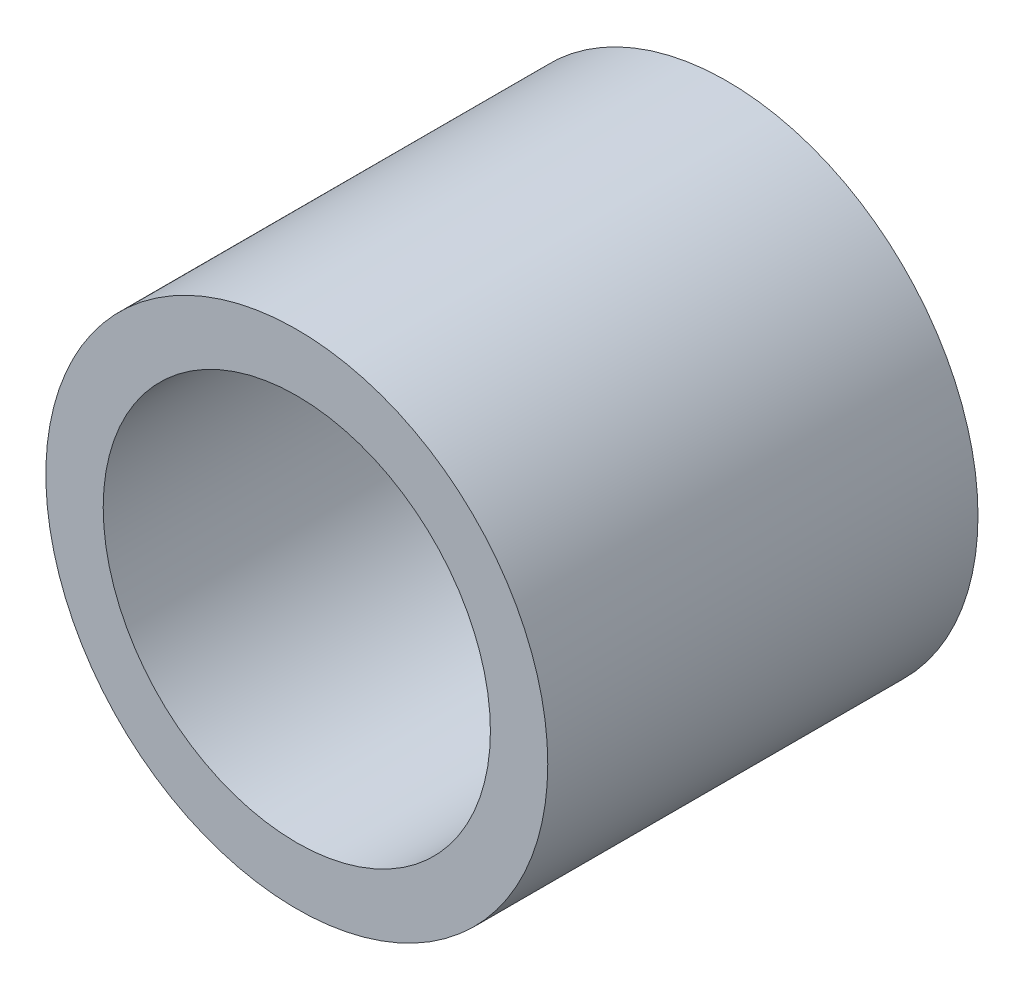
ISO-10303-21;
HEADER;
FILE_DESCRIPTION(('STEP AP214'),'2;1');
FILE_NAME('part.step','',(''),(''),'','','');
FILE_SCHEMA(('AUTOMOTIVE_DESIGN { 1 0 10303 214 1 1 1 1 }'));
ENDSEC;
DATA;
#1=APPLICATION_CONTEXT('core data for automotive mechanical design processes');
#2=APPLICATION_PROTOCOL_DEFINITION('international standard','automotive_design',2000,#1);
#3=PRODUCT_CONTEXT('',#1,'mechanical');
#4=PRODUCT('Part','Part','',(#3));
#5=PRODUCT_RELATED_PRODUCT_CATEGORY('part','',(#4));
#6=PRODUCT_DEFINITION_FORMATION('','',#4);
#7=PRODUCT_DEFINITION_CONTEXT('part definition',#1,'design');
#8=PRODUCT_DEFINITION('design','',#6,#7);
#9=PRODUCT_DEFINITION_SHAPE('','',#8);
#10=(LENGTH_UNIT() NAMED_UNIT(*) SI_UNIT(.MILLI.,.METRE.));
#11=(NAMED_UNIT(*) PLANE_ANGLE_UNIT() SI_UNIT($,.RADIAN.));
#12=(NAMED_UNIT(*) SI_UNIT($,.STERADIAN.) SOLID_ANGLE_UNIT());
#13=UNCERTAINTY_MEASURE_WITH_UNIT(LENGTH_MEASURE(1.E-05),#10,'distance_accuracy_value','');
#14=(GEOMETRIC_REPRESENTATION_CONTEXT(3) GLOBAL_UNCERTAINTY_ASSIGNED_CONTEXT((#13)) GLOBAL_UNIT_ASSIGNED_CONTEXT((#10,
#11,#12)) REPRESENTATION_CONTEXT('',''));
#15=CARTESIAN_POINT('',(0.,0.,0.));
#16=DIRECTION('',(0.,0.,1.));
#17=DIRECTION('',(1.,0.,0.));
#18=AXIS2_PLACEMENT_3D('',#15,#16,#17);
#19=CARTESIAN_POINT('',(-4.44089209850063E-13,0.,30.0000000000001));
#20=DIRECTION('',(0.,0.,-1.));
#21=DIRECTION('',(-1.,0.,0.));
#22=AXIS2_PLACEMENT_3D('',#19,#20,#21);
#23=CYLINDRICAL_SURFACE('',#22,17.5);
#24=CARTESIAN_POINT('',(-4.44089209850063E-13,0.,30.0000000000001));
#25=DIRECTION('',(0.,0.,1.));
#26=DIRECTION('',(1.,0.,0.));
#27=AXIS2_PLACEMENT_3D('',#24,#25,#26);
#28=CIRCLE('',#27,17.5);
#29=CARTESIAN_POINT('',(17.4999999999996,0.,30.0000000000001));
#30=VERTEX_POINT('',#29);
#31=EDGE_CURVE('E10',#30,#30,#28,.T.);
#32=ORIENTED_EDGE('',*,*,#31,.F.);
#33=EDGE_LOOP('',(#32));
#34=FACE_BOUND('',#33,.T.);
#35=CARTESIAN_POINT('',(0.,0.,-1.11022302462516E-13));
#36=DIRECTION('',(0.,0.,1.));
#37=DIRECTION('',(1.,0.,0.));
#38=AXIS2_PLACEMENT_3D('',#35,#36,#37);
#39=CIRCLE('',#38,17.5);
#40=CARTESIAN_POINT('',(17.5,0.,-1.1296519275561E-13));
#41=VERTEX_POINT('',#40);
#42=EDGE_CURVE('E36',#41,#41,#39,.T.);
#43=ORIENTED_EDGE('',*,*,#42,.T.);
#44=EDGE_LOOP('',(#43));
#45=FACE_BOUND('',#44,.T.);
#46=ADVANCED_FACE('F30',(#34,#45),#23,.T.);
#47=CARTESIAN_POINT('',(-4.44089209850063E-13,0.,30.0000000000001));
#48=DIRECTION('',(0.,0.,1.));
#49=DIRECTION('',(1.,0.,0.));
#50=AXIS2_PLACEMENT_3D('',#47,#48,#49);
#51=PLANE('',#50);
#52=CARTESIAN_POINT('',(-4.44089209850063E-13,0.,30.0000000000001));
#53=DIRECTION('',(0.,0.,1.));
#54=DIRECTION('',(1.,0.,0.));
#55=AXIS2_PLACEMENT_3D('',#52,#53,#54);
#56=CIRCLE('',#55,13.5);
#57=CARTESIAN_POINT('',(13.4999999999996,0.,30.0000000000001));
#58=VERTEX_POINT('',#57);
#59=EDGE_CURVE('E44',#58,#58,#56,.T.);
#60=ORIENTED_EDGE('',*,*,#59,.F.);
#61=EDGE_LOOP('',(#60));
#62=FACE_BOUND('',#61,.T.);
#63=ORIENTED_EDGE('',*,*,#31,.T.);
#64=EDGE_LOOP('',(#63));
#65=FACE_BOUND('',#64,.T.);
#66=ADVANCED_FACE('F52',(#62,#65),#51,.T.);
#67=CARTESIAN_POINT('',(0.,0.,-1.11022302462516E-13));
#68=DIRECTION('',(0.,0.,1.));
#69=DIRECTION('',(1.,0.,0.));
#70=AXIS2_PLACEMENT_3D('',#67,#68,#69);
#71=PLANE('',#70);
#72=CARTESIAN_POINT('',(0.,0.,-1.11022302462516E-13));
#73=DIRECTION('',(0.,0.,1.));
#74=DIRECTION('',(1.,0.,0.));
#75=AXIS2_PLACEMENT_3D('',#72,#73,#74);
#76=CIRCLE('',#75,13.5);
#77=CARTESIAN_POINT('',(13.5,0.,-1.1252110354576E-13));
#78=VERTEX_POINT('',#77);
#79=EDGE_CURVE('E40',#78,#78,#76,.T.);
#80=ORIENTED_EDGE('',*,*,#79,.T.);
#81=EDGE_LOOP('',(#80));
#82=FACE_BOUND('',#81,.T.);
#83=ORIENTED_EDGE('',*,*,#42,.F.);
#84=EDGE_LOOP('',(#83));
#85=FACE_BOUND('',#84,.T.);
#86=ADVANCED_FACE('F54',(#82,#85),#71,.F.);
#87=CARTESIAN_POINT('',(0.,0.,-1.11022302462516E-13));
#88=DIRECTION('',(0.,0.,1.));
#89=DIRECTION('',(1.,0.,0.));
#90=AXIS2_PLACEMENT_3D('',#87,#88,#89);
#91=CYLINDRICAL_SURFACE('',#90,13.5);
#92=ORIENTED_EDGE('',*,*,#79,.F.);
#93=EDGE_LOOP('',(#92));
#94=FACE_BOUND('',#93,.T.);
#95=ORIENTED_EDGE('',*,*,#59,.T.);
#96=EDGE_LOOP('',(#95));
#97=FACE_BOUND('',#96,.T.);
#98=ADVANCED_FACE('F50',(#94,#97),#91,.F.);
#99=CLOSED_SHELL('',(#46,#66,#86,#98));
#100=MANIFOLD_SOLID_BREP('B2',#99);
#101=ADVANCED_BREP_SHAPE_REPRESENTATION('',(#18,#100),#14);
#102=SHAPE_DEFINITION_REPRESENTATION(#9,#101);
ENDSEC;
END-ISO-10303-21;
